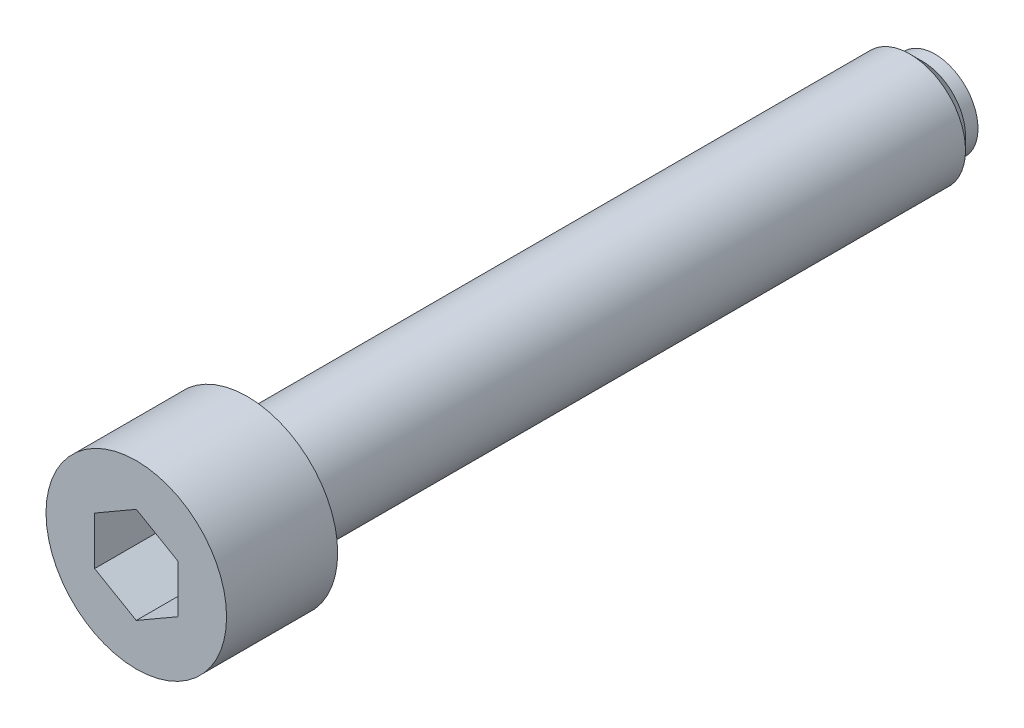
ISO-10303-21;
HEADER;
FILE_DESCRIPTION(('STEP AP214'),'2;1');
FILE_NAME('part.step','',(''),(''),'','','');
FILE_SCHEMA(('AUTOMOTIVE_DESIGN { 1 0 10303 214 1 1 1 1 }'));
ENDSEC;
DATA;
#1=APPLICATION_CONTEXT('core data for automotive mechanical design processes');
#2=APPLICATION_PROTOCOL_DEFINITION('international standard','automotive_design',2000,#1);
#3=PRODUCT_CONTEXT('',#1,'mechanical');
#4=PRODUCT('Part','Part','',(#3));
#5=PRODUCT_RELATED_PRODUCT_CATEGORY('part','',(#4));
#6=PRODUCT_DEFINITION_FORMATION('','',#4);
#7=PRODUCT_DEFINITION_CONTEXT('part definition',#1,'design');
#8=PRODUCT_DEFINITION('design','',#6,#7);
#9=PRODUCT_DEFINITION_SHAPE('','',#8);
#10=(LENGTH_UNIT() NAMED_UNIT(*) SI_UNIT(.MILLI.,.METRE.));
#11=(NAMED_UNIT(*) PLANE_ANGLE_UNIT() SI_UNIT($,.RADIAN.));
#12=(NAMED_UNIT(*) SI_UNIT($,.STERADIAN.) SOLID_ANGLE_UNIT());
#13=UNCERTAINTY_MEASURE_WITH_UNIT(LENGTH_MEASURE(1.E-05),#10,'distance_accuracy_value','');
#14=(GEOMETRIC_REPRESENTATION_CONTEXT(3) GLOBAL_UNCERTAINTY_ASSIGNED_CONTEXT((#13)) GLOBAL_UNIT_ASSIGNED_CONTEXT((#10,
#11,#12)) REPRESENTATION_CONTEXT('',''));
#15=CARTESIAN_POINT('',(0.,0.,0.));
#16=DIRECTION('',(0.,0.,1.));
#17=DIRECTION('',(1.,0.,0.));
#18=AXIS2_PLACEMENT_3D('',#15,#16,#17);
#19=CARTESIAN_POINT('',(0.,0.,1.58113883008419));
#20=DIRECTION('',(0.,0.,1.));
#21=DIRECTION('',(-1.,0.,0.));
#22=AXIS2_PLACEMENT_3D('',#19,#20,#21);
#23=SPHERICAL_SURFACE('',#22,2.75);
#24=CARTESIAN_POINT('',(0.,0.,0.5));
#25=DIRECTION('',(0.,0.,1.));
#26=DIRECTION('',(1.,0.,0.));
#27=AXIS2_PLACEMENT_3D('',#24,#25,#26);
#28=CIRCLE('',#27,2.52856457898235);
#29=CARTESIAN_POINT('',(-2.52856457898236,0.,0.5));
#30=VERTEX_POINT('',#29);
#31=EDGE_CURVE('E133',#30,#30,#28,.T.);
#32=CARTESIAN_POINT('',(0.,0.,0.));
#33=DIRECTION('',(0.,0.,1.));
#34=DIRECTION('',(1.,0.,0.));
#35=AXIS2_PLACEMENT_3D('',#32,#33,#34);
#36=CIRCLE('',#35,2.25);
#37=CARTESIAN_POINT('',(-2.25000000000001,0.,0.));
#38=VERTEX_POINT('',#37);
#39=EDGE_CURVE('E10',#38,#38,#36,.T.);
#40=CARTESIAN_POINT('',(-2.52856457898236,0.,0.5));
#41=CARTESIAN_POINT('',(-2.52621637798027,0.,0.494508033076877));
#42=CARTESIAN_POINT('',(-2.52385028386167,0.,0.489023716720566));
#43=CARTESIAN_POINT('',(-2.51908241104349,0.,0.478070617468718));
#44=CARTESIAN_POINT('',(-2.5166806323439,0.,0.472601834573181));
#45=CARTESIAN_POINT('',(-2.51184149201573,0.,0.461680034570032));
#46=CARTESIAN_POINT('',(-2.50940413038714,0.,0.456227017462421));
#47=CARTESIAN_POINT('',(-2.50449392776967,0.,0.445336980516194));
#48=CARTESIAN_POINT('',(-2.5020210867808,0.,0.439899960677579));
#49=CARTESIAN_POINT('',(-2.49704003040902,0.,0.429042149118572));
#50=CARTESIAN_POINT('',(-2.49453181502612,0.,0.423621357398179));
#51=CARTESIAN_POINT('',(-2.4894801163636,0.,0.41279623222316));
#52=CARTESIAN_POINT('',(-2.48693663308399,0.,0.407391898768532));
#53=CARTESIAN_POINT('',(-2.48181450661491,0.,0.396599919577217));
#54=CARTESIAN_POINT('',(-2.47923586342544,0.,0.391212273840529));
#55=CARTESIAN_POINT('',(-2.4740435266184,0.,0.380453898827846));
#56=CARTESIAN_POINT('',(-2.47142983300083,0.,0.375083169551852));
#57=CARTESIAN_POINT('',(-2.46616750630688,0.,0.364358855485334));
#58=CARTESIAN_POINT('',(-2.4635188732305,0.,0.35900527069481));
#59=CARTESIAN_POINT('',(-2.45818678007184,0.,0.348315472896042));
#60=CARTESIAN_POINT('',(-2.45550331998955,0.,0.342979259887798));
#61=CARTESIAN_POINT('',(-2.45010168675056,0.,0.332324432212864));
#62=CARTESIAN_POINT('',(-2.44738351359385,0.,0.327005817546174));
#63=CARTESIAN_POINT('',(-2.44191256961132,0.,0.316386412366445));
#64=CARTESIAN_POINT('',(-2.4391597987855,0.,0.311085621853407));
#65=CARTESIAN_POINT('',(-2.43361977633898,0.,0.300502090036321));
#66=CARTESIAN_POINT('',(-2.43083252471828,0.,0.295219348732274));
#67=CARTESIAN_POINT('',(-2.42522365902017,0.,0.284672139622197));
#68=CARTESIAN_POINT('',(-2.42240204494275,0.,0.279407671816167));
#69=CARTESIAN_POINT('',(-2.41672457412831,0.,0.268897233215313));
#70=CARTESIAN_POINT('',(-2.41386871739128,0.,0.263651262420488));
#71=CARTESIAN_POINT('',(-2.40812288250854,0.,0.253178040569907));
#72=CARTESIAN_POINT('',(-2.40523290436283,0.,0.247950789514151));
#73=CARTESIAN_POINT('',(-2.39941894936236,0.,0.237515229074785));
#74=CARTESIAN_POINT('',(-2.39649497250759,0.,0.232306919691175));
#75=CARTESIAN_POINT('',(-2.39061314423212,0.,0.221909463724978));
#76=CARTESIAN_POINT('',(-2.38765529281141,0.,0.21672031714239));
#77=CARTESIAN_POINT('',(-2.38170584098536,0.,0.206361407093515));
#78=CARTESIAN_POINT('',(-2.37871424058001,0.,0.201191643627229));
#79=CARTESIAN_POINT('',(-2.3726974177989,0.,0.190871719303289));
#80=CARTESIAN_POINT('',(-2.36967219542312,0.,0.185721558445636));
#81=CARTESIAN_POINT('',(-2.36358825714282,0.,0.175441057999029));
#82=CARTESIAN_POINT('',(-2.3605295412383,0.,0.170310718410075));
#83=CARTESIAN_POINT('',(-2.35437874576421,0.,0.160070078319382));
#84=CARTESIAN_POINT('',(-2.35128666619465,0.,0.154959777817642));
#85=CARTESIAN_POINT('',(-2.34506927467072,0.,0.144759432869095));
#86=CARTESIAN_POINT('',(-2.34194396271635,0.,0.139669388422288));
#87=CARTESIAN_POINT('',(-2.33566023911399,0.,0.129509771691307));
#88=CARTESIAN_POINT('',(-2.33250182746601,0.,0.124440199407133));
#89=CARTESIAN_POINT('',(-2.32615203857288,0.,0.114321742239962));
#90=CARTESIAN_POINT('',(-2.32296066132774,0.,0.109272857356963));
#91=CARTESIAN_POINT('',(-2.31654507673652,0.,0.0991959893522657));
#92=CARTESIAN_POINT('',(-2.31332086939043,0.,0.0941680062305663));
#93=CARTESIAN_POINT('',(-2.30683976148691,0.,0.0841331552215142));
#94=CARTESIAN_POINT('',(-2.30358286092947,0.,0.0791262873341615));
#95=CARTESIAN_POINT('',(-2.29703650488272,0.,0.069133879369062));
#96=CARTESIAN_POINT('',(-2.29374704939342,0.,0.0641483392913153));
#97=CARTESIAN_POINT('',(-2.28713572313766,0.,0.0541987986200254));
#98=CARTESIAN_POINT('',(-2.2838138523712,0.,0.0492347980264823));
#99=CARTESIAN_POINT('',(-2.27713783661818,0.,0.0393285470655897));
#100=CARTESIAN_POINT('',(-2.27378369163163,0.,0.0343862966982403));
#101=CARTESIAN_POINT('',(-2.26704326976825,0.,0.0245237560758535));
#102=CARTESIAN_POINT('',(-2.26365699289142,0.,0.0196034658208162));
#103=CARTESIAN_POINT('',(-2.25685245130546,0.,0.00978505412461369));
#104=CARTESIAN_POINT('',(-2.25343418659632,0.,0.00488693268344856));
#105=CARTESIAN_POINT('',(-2.25000000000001,0.,0.));
#106=B_SPLINE_CURVE_WITH_KNOTS('',3,(#40,#41,#42,#43,#44,#45,#46,#47,#48,#49,#50,#51,#52,#53,
#54,#55,#56,#57,#58,#59,#60,#61,#62,#63,#64,#65,#66,#67,#68,#69,#70,#71,#72,#73,#74,#75,#76,#77,
#78,#79,#80,#81,#82,#83,#84,#85,#86,#87,#88,#89,#90,#91,#92,#93,#94,#95,#96,#97,#98,#99,#100,
#101,#102,#103,#104,#105),.UNSPECIFIED.,.F.,.F.,(4,2,2,2,2,2,2,2,2,2,2,2,2,2,2,2,2,2,2,2,2,2,2,
2,2,2,2,2,2,2,2,2,4),(0.,0.0179187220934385,0.0358374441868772,0.0537561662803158,
0.0716748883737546,0.089593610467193,0.107512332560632,0.125431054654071,0.143349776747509,
0.161268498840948,0.179187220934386,0.197105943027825,0.215024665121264,0.232943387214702,
0.250862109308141,0.26878083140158,0.286699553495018,0.304618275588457,0.322536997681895,
0.340455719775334,0.358374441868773,0.376293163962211,0.39421188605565,0.412130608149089,
0.430049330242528,0.447968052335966,0.465886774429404,0.483805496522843,0.501724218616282,
0.519642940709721,0.537561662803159,0.555480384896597,0.573399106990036),.UNSPECIFIED.);
#107=EDGE_CURVE('BSEAM16',#30,#38,#106,.T.);
#108=ORIENTED_EDGE('',*,*,#31,.F.);
#109=ORIENTED_EDGE('',*,*,#39,.T.);
#110=ORIENTED_EDGE('',*,*,#107,.T.);
#111=ORIENTED_EDGE('',*,*,#107,.F.);
#112=EDGE_LOOP('',(#108,#110,#109,#111));
#113=FACE_BOUND('',#112,.T.);
#114=ADVANCED_FACE('F16',(#113),#23,.T.);
#115=CARTESIAN_POINT('',(0.,0.,0.));
#116=DIRECTION('',(0.,0.,1.));
#117=DIRECTION('',(1.,0.,0.));
#118=AXIS2_PLACEMENT_3D('',#115,#116,#117);
#119=PLANE('',#118);
#120=ORIENTED_EDGE('',*,*,#39,.F.);
#121=EDGE_LOOP('',(#120));
#122=FACE_BOUND('',#121,.T.);
#123=ADVANCED_FACE('F208',(#122),#119,.F.);
#124=CARTESIAN_POINT('',(-6.5,0.,58.));
#125=DIRECTION('',(0.,0.,-1.));
#126=DIRECTION('',(-1.,0.,0.));
#127=AXIS2_PLACEMENT_3D('',#124,#125,#126);
#128=PLANE('',#127);
#129=DIRECTION('',(-0.866025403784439,-0.5,0.));
#130=VECTOR('',#129,1.);
#131=CARTESIAN_POINT('',(0.,3.46410161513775,58.));
#132=LINE('',#131,#130);
#133=CARTESIAN_POINT('',(0.,3.46410161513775,58.));
#134=VERTEX_POINT('',#133);
#135=CARTESIAN_POINT('',(-3.,1.73205080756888,58.));
#136=VERTEX_POINT('',#135);
#137=EDGE_CURVE('E114',#134,#136,#132,.T.);
#138=ORIENTED_EDGE('',*,*,#137,.F.);
#139=DIRECTION('',(-0.866025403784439,0.5,0.));
#140=VECTOR('',#139,1.);
#141=CARTESIAN_POINT('',(3.,1.73205080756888,58.));
#142=LINE('',#141,#140);
#143=CARTESIAN_POINT('',(3.,1.73205080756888,58.));
#144=VERTEX_POINT('',#143);
#145=EDGE_CURVE('E31',#144,#134,#142,.T.);
#146=ORIENTED_EDGE('',*,*,#145,.F.);
#147=DIRECTION('',(0.,1.,0.));
#148=VECTOR('',#147,1.);
#149=CARTESIAN_POINT('',(3.,-1.73205080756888,58.));
#150=LINE('',#149,#148);
#151=CARTESIAN_POINT('',(3.,-1.73205080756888,58.));
#152=VERTEX_POINT('',#151);
#153=EDGE_CURVE('E127',#152,#144,#150,.T.);
#154=ORIENTED_EDGE('',*,*,#153,.F.);
#155=DIRECTION('',(0.866025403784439,0.5,0.));
#156=VECTOR('',#155,1.);
#157=CARTESIAN_POINT('',(0.,-3.46410161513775,58.));
#158=LINE('',#157,#156);
#159=CARTESIAN_POINT('',(0.,-3.46410161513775,58.));
#160=VERTEX_POINT('',#159);
#161=EDGE_CURVE('E124',#160,#152,#158,.T.);
#162=ORIENTED_EDGE('',*,*,#161,.F.);
#163=DIRECTION('',(0.866025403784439,-0.5,0.));
#164=VECTOR('',#163,1.);
#165=CARTESIAN_POINT('',(-3.,-1.73205080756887,58.));
#166=LINE('',#165,#164);
#167=CARTESIAN_POINT('',(-3.,-1.73205080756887,58.));
#168=VERTEX_POINT('',#167);
#169=EDGE_CURVE('E79',#168,#160,#166,.T.);
#170=ORIENTED_EDGE('',*,*,#169,.F.);
#171=DIRECTION('',(0.,-1.,0.));
#172=VECTOR('',#171,1.);
#173=CARTESIAN_POINT('',(-3.,1.73205080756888,58.));
#174=LINE('',#173,#172);
#175=EDGE_CURVE('E118',#136,#168,#174,.T.);
#176=ORIENTED_EDGE('',*,*,#175,.F.);
#177=EDGE_LOOP('',(#138,#146,#154,#162,#170,#176));
#178=FACE_BOUND('',#177,.T.);
#179=CARTESIAN_POINT('',(0.,0.,58.));
#180=DIRECTION('',(0.,0.,1.));
#181=DIRECTION('',(1.,0.,0.));
#182=AXIS2_PLACEMENT_3D('',#179,#180,#181);
#183=CIRCLE('',#182,6.5);
#184=CARTESIAN_POINT('',(6.5,0.,58.));
#185=VERTEX_POINT('',#184);
#186=EDGE_CURVE('E24',#185,#185,#183,.T.);
#187=ORIENTED_EDGE('',*,*,#186,.T.);
#188=EDGE_LOOP('',(#187));
#189=FACE_BOUND('',#188,.T.);
#190=ADVANCED_FACE('F167',(#178,#189),#128,.F.);
#191=CARTESIAN_POINT('',(0.,0.,0.));
#192=DIRECTION('',(0.,0.,1.));
#193=DIRECTION('',(1.,0.,0.));
#194=AXIS2_PLACEMENT_3D('',#191,#192,#193);
#195=CYLINDRICAL_SURFACE('',#194,6.5);
#196=ORIENTED_EDGE('',*,*,#186,.F.);
#197=EDGE_LOOP('',(#196));
#198=FACE_BOUND('',#197,.T.);
#199=CARTESIAN_POINT('',(0.,0.,50.));
#200=DIRECTION('',(0.,0.,1.));
#201=DIRECTION('',(1.,0.,0.));
#202=AXIS2_PLACEMENT_3D('',#199,#200,#201);
#203=CIRCLE('',#202,6.5);
#204=CARTESIAN_POINT('',(6.5,0.,50.));
#205=VERTEX_POINT('',#204);
#206=EDGE_CURVE('E160',#205,#205,#203,.T.);
#207=ORIENTED_EDGE('',*,*,#206,.T.);
#208=EDGE_LOOP('',(#207));
#209=FACE_BOUND('',#208,.T.);
#210=ADVANCED_FACE('F169',(#198,#209),#195,.T.);
#211=CARTESIAN_POINT('',(-4.,0.,50.));
#212=DIRECTION('',(0.,0.,1.));
#213=DIRECTION('',(1.,0.,0.));
#214=AXIS2_PLACEMENT_3D('',#211,#212,#213);
#215=PLANE('',#214);
#216=ORIENTED_EDGE('',*,*,#206,.F.);
#217=EDGE_LOOP('',(#216));
#218=FACE_BOUND('',#217,.T.);
#219=CARTESIAN_POINT('',(0.,0.,50.));
#220=DIRECTION('',(0.,0.,1.));
#221=DIRECTION('',(1.,0.,0.));
#222=AXIS2_PLACEMENT_3D('',#219,#220,#221);
#223=CIRCLE('',#222,4.);
#224=CARTESIAN_POINT('',(4.,0.,50.));
#225=VERTEX_POINT('',#224);
#226=EDGE_CURVE('E157',#225,#225,#223,.T.);
#227=ORIENTED_EDGE('',*,*,#226,.T.);
#228=EDGE_LOOP('',(#227));
#229=FACE_BOUND('',#228,.T.);
#230=ADVANCED_FACE('F172',(#218,#229),#215,.F.);
#231=CARTESIAN_POINT('',(0.,0.,0.));
#232=DIRECTION('',(0.,0.,1.));
#233=DIRECTION('',(1.,0.,0.));
#234=AXIS2_PLACEMENT_3D('',#231,#232,#233);
#235=CYLINDRICAL_SURFACE('',#234,4.);
#236=ORIENTED_EDGE('',*,*,#226,.F.);
#237=EDGE_LOOP('',(#236));
#238=FACE_BOUND('',#237,.T.);
#239=CARTESIAN_POINT('',(0.,0.,2.3));
#240=DIRECTION('',(0.,0.,1.));
#241=DIRECTION('',(1.,0.,0.));
#242=AXIS2_PLACEMENT_3D('',#239,#240,#241);
#243=CIRCLE('',#242,4.);
#244=CARTESIAN_POINT('',(4.,0.,2.3));
#245=VERTEX_POINT('',#244);
#246=EDGE_CURVE('E153',#245,#245,#243,.T.);
#247=ORIENTED_EDGE('',*,*,#246,.T.);
#248=EDGE_LOOP('',(#247));
#249=FACE_BOUND('',#248,.T.);
#250=ADVANCED_FACE('F178',(#238,#249),#235,.T.);
#251=CARTESIAN_POINT('',(0.,0.,1.4));
#252=DIRECTION('',(0.,0.,1.));
#253=DIRECTION('',(1.,0.,0.));
#254=AXIS2_PLACEMENT_3D('',#251,#252,#253);
#255=CONICAL_SURFACE('',#254,3.1,0.785398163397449);
#256=ORIENTED_EDGE('',*,*,#246,.F.);
#257=EDGE_LOOP('',(#256));
#258=FACE_BOUND('',#257,.T.);
#259=CARTESIAN_POINT('',(0.,0.,1.4));
#260=DIRECTION('',(0.,0.,1.));
#261=DIRECTION('',(1.,0.,0.));
#262=AXIS2_PLACEMENT_3D('',#259,#260,#261);
#263=CIRCLE('',#262,3.1);
#264=CARTESIAN_POINT('',(3.1,0.,1.4));
#265=VERTEX_POINT('',#264);
#266=EDGE_CURVE('E149',#265,#265,#263,.T.);
#267=ORIENTED_EDGE('',*,*,#266,.T.);
#268=EDGE_LOOP('',(#267));
#269=FACE_BOUND('',#268,.T.);
#270=ADVANCED_FACE('F184',(#258,#269),#255,.T.);
#271=CARTESIAN_POINT('',(0.,0.,0.));
#272=DIRECTION('',(0.,0.,1.));
#273=DIRECTION('',(1.,0.,0.));
#274=AXIS2_PLACEMENT_3D('',#271,#272,#273);
#275=CYLINDRICAL_SURFACE('',#274,3.1);
#276=ORIENTED_EDGE('',*,*,#266,.F.);
#277=EDGE_LOOP('',(#276));
#278=FACE_BOUND('',#277,.T.);
#279=CARTESIAN_POINT('',(0.,0.,0.5));
#280=DIRECTION('',(0.,0.,1.));
#281=DIRECTION('',(1.,0.,0.));
#282=AXIS2_PLACEMENT_3D('',#279,#280,#281);
#283=CIRCLE('',#282,3.1);
#284=CARTESIAN_POINT('',(3.1,0.,0.5));
#285=VERTEX_POINT('',#284);
#286=EDGE_CURVE('E145',#285,#285,#283,.T.);
#287=ORIENTED_EDGE('',*,*,#286,.T.);
#288=EDGE_LOOP('',(#287));
#289=FACE_BOUND('',#288,.T.);
#290=ADVANCED_FACE('F190',(#278,#289),#275,.T.);
#291=CARTESIAN_POINT('',(-2.52856457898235,0.,0.5));
#292=DIRECTION('',(0.,0.,1.));
#293=DIRECTION('',(1.,0.,0.));
#294=AXIS2_PLACEMENT_3D('',#291,#292,#293);
#295=PLANE('',#294);
#296=ORIENTED_EDGE('',*,*,#286,.F.);
#297=EDGE_LOOP('',(#296));
#298=FACE_BOUND('',#297,.T.);
#299=ORIENTED_EDGE('',*,*,#31,.T.);
#300=EDGE_LOOP('',(#299));
#301=FACE_BOUND('',#300,.T.);
#302=ADVANCED_FACE('F196',(#298,#301),#295,.F.);
#303=CARTESIAN_POINT('',(3.,1.73205080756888,53.));
#304=DIRECTION('',(0.5,0.866025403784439,0.));
#305=DIRECTION('',(-0.866025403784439,0.5,0.));
#306=AXIS2_PLACEMENT_3D('',#303,#304,#305);
#307=PLANE('',#306);
#308=ORIENTED_EDGE('',*,*,#145,.T.);
#309=DIRECTION('',(0.,0.,1.));
#310=VECTOR('',#309,1.);
#311=CARTESIAN_POINT('',(0.,3.46410161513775,53.));
#312=LINE('',#311,#310);
#313=CARTESIAN_POINT('',(0.,3.46410161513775,53.));
#314=VERTEX_POINT('',#313);
#315=EDGE_CURVE('E61',#314,#134,#312,.T.);
#316=ORIENTED_EDGE('',*,*,#315,.F.);
#317=DIRECTION('',(-0.866025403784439,0.5,0.));
#318=VECTOR('',#317,1.);
#319=CARTESIAN_POINT('',(3.,1.73205080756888,53.));
#320=LINE('',#319,#318);
#321=CARTESIAN_POINT('',(3.,1.73205080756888,53.));
#322=VERTEX_POINT('',#321);
#323=EDGE_CURVE('E130',#322,#314,#320,.T.);
#324=ORIENTED_EDGE('',*,*,#323,.F.);
#325=DIRECTION('',(0.,0.,1.));
#326=VECTOR('',#325,1.);
#327=CARTESIAN_POINT('',(3.,1.73205080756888,53.));
#328=LINE('',#327,#326);
#329=EDGE_CURVE('E39',#322,#144,#328,.T.);
#330=ORIENTED_EDGE('',*,*,#329,.T.);
#331=EDGE_LOOP('',(#308,#316,#324,#330));
#332=FACE_BOUND('',#331,.T.);
#333=ADVANCED_FACE('F202',(#332),#307,.F.);
#334=CARTESIAN_POINT('',(3.,-1.73205080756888,53.));
#335=DIRECTION('',(1.,0.,0.));
#336=DIRECTION('',(0.,0.,-1.));
#337=AXIS2_PLACEMENT_3D('',#334,#335,#336);
#338=PLANE('',#337);
#339=ORIENTED_EDGE('',*,*,#153,.T.);
#340=ORIENTED_EDGE('',*,*,#329,.F.);
#341=DIRECTION('',(0.,1.,0.));
#342=VECTOR('',#341,1.);
#343=CARTESIAN_POINT('',(3.,-1.73205080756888,53.));
#344=LINE('',#343,#342);
#345=CARTESIAN_POINT('',(3.,-1.73205080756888,53.));
#346=VERTEX_POINT('',#345);
#347=EDGE_CURVE('E93',#346,#322,#344,.T.);
#348=ORIENTED_EDGE('',*,*,#347,.F.);
#349=DIRECTION('',(0.,0.,1.));
#350=VECTOR('',#349,1.);
#351=CARTESIAN_POINT('',(3.,-1.73205080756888,53.));
#352=LINE('',#351,#350);
#353=EDGE_CURVE('E84',#346,#152,#352,.T.);
#354=ORIENTED_EDGE('',*,*,#353,.T.);
#355=EDGE_LOOP('',(#339,#340,#348,#354));
#356=FACE_BOUND('',#355,.T.);
#357=ADVANCED_FACE('F222',(#356),#338,.F.);
#358=CARTESIAN_POINT('',(0.,-3.46410161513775,53.));
#359=DIRECTION('',(0.5,-0.866025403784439,0.));
#360=DIRECTION('',(0.866025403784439,0.5,0.));
#361=AXIS2_PLACEMENT_3D('',#358,#359,#360);
#362=PLANE('',#361);
#363=ORIENTED_EDGE('',*,*,#161,.T.);
#364=ORIENTED_EDGE('',*,*,#353,.F.);
#365=DIRECTION('',(0.866025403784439,0.5,0.));
#366=VECTOR('',#365,1.);
#367=CARTESIAN_POINT('',(0.,-3.46410161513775,53.));
#368=LINE('',#367,#366);
#369=CARTESIAN_POINT('',(0.,-3.46410161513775,53.));
#370=VERTEX_POINT('',#369);
#371=EDGE_CURVE('E88',#370,#346,#368,.T.);
#372=ORIENTED_EDGE('',*,*,#371,.F.);
#373=DIRECTION('',(0.,0.,1.));
#374=VECTOR('',#373,1.);
#375=CARTESIAN_POINT('',(0.,-3.46410161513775,53.));
#376=LINE('',#375,#374);
#377=EDGE_CURVE('E72',#370,#160,#376,.T.);
#378=ORIENTED_EDGE('',*,*,#377,.T.);
#379=EDGE_LOOP('',(#363,#364,#372,#378));
#380=FACE_BOUND('',#379,.T.);
#381=ADVANCED_FACE('F89',(#380),#362,.F.);
#382=CARTESIAN_POINT('',(-3.,-1.73205080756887,53.));
#383=DIRECTION('',(-0.5,-0.866025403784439,0.));
#384=DIRECTION('',(0.866025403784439,-0.5,0.));
#385=AXIS2_PLACEMENT_3D('',#382,#383,#384);
#386=PLANE('',#385);
#387=ORIENTED_EDGE('',*,*,#169,.T.);
#388=ORIENTED_EDGE('',*,*,#377,.F.);
#389=DIRECTION('',(0.866025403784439,-0.5,0.));
#390=VECTOR('',#389,1.);
#391=CARTESIAN_POINT('',(-3.,-1.73205080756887,53.));
#392=LINE('',#391,#390);
#393=CARTESIAN_POINT('',(-3.,-1.73205080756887,53.));
#394=VERTEX_POINT('',#393);
#395=EDGE_CURVE('E76',#394,#370,#392,.T.);
#396=ORIENTED_EDGE('',*,*,#395,.F.);
#397=DIRECTION('',(0.,0.,1.));
#398=VECTOR('',#397,1.);
#399=CARTESIAN_POINT('',(-3.,-1.73205080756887,53.));
#400=LINE('',#399,#398);
#401=EDGE_CURVE('E85',#394,#168,#400,.T.);
#402=ORIENTED_EDGE('',*,*,#401,.T.);
#403=EDGE_LOOP('',(#387,#388,#396,#402));
#404=FACE_BOUND('',#403,.T.);
#405=ADVANCED_FACE('F74',(#404),#386,.F.);
#406=CARTESIAN_POINT('',(-3.,1.73205080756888,53.));
#407=DIRECTION('',(-1.,0.,0.));
#408=DIRECTION('',(0.,0.,1.));
#409=AXIS2_PLACEMENT_3D('',#406,#407,#408);
#410=PLANE('',#409);
#411=ORIENTED_EDGE('',*,*,#175,.T.);
#412=ORIENTED_EDGE('',*,*,#401,.F.);
#413=DIRECTION('',(0.,-1.,0.));
#414=VECTOR('',#413,1.);
#415=CARTESIAN_POINT('',(-3.,1.73205080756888,53.));
#416=LINE('',#415,#414);
#417=CARTESIAN_POINT('',(-3.,1.73205080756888,53.));
#418=VERTEX_POINT('',#417);
#419=EDGE_CURVE('E99',#418,#394,#416,.T.);
#420=ORIENTED_EDGE('',*,*,#419,.F.);
#421=DIRECTION('',(0.,0.,1.));
#422=VECTOR('',#421,1.);
#423=CARTESIAN_POINT('',(-3.,1.73205080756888,53.));
#424=LINE('',#423,#422);
#425=EDGE_CURVE('E138',#418,#136,#424,.T.);
#426=ORIENTED_EDGE('',*,*,#425,.T.);
#427=EDGE_LOOP('',(#411,#412,#420,#426));
#428=FACE_BOUND('',#427,.T.);
#429=ADVANCED_FACE('F226',(#428),#410,.F.);
#430=CARTESIAN_POINT('',(0.,3.46410161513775,53.));
#431=DIRECTION('',(-0.5,0.866025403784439,0.));
#432=DIRECTION('',(-0.866025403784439,-0.5,0.));
#433=AXIS2_PLACEMENT_3D('',#430,#431,#432);
#434=PLANE('',#433);
#435=ORIENTED_EDGE('',*,*,#137,.T.);
#436=ORIENTED_EDGE('',*,*,#425,.F.);
#437=DIRECTION('',(-0.866025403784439,-0.5,0.));
#438=VECTOR('',#437,1.);
#439=CARTESIAN_POINT('',(0.,3.46410161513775,53.));
#440=LINE('',#439,#438);
#441=EDGE_CURVE('E106',#314,#418,#440,.T.);
#442=ORIENTED_EDGE('',*,*,#441,.F.);
#443=ORIENTED_EDGE('',*,*,#315,.T.);
#444=EDGE_LOOP('',(#435,#436,#442,#443));
#445=FACE_BOUND('',#444,.T.);
#446=ADVANCED_FACE('F223',(#445),#434,.F.);
#447=CARTESIAN_POINT('',(0.,0.,53.));
#448=DIRECTION('',(0.,0.,1.));
#449=DIRECTION('',(1.,0.,0.));
#450=AXIS2_PLACEMENT_3D('',#447,#448,#449);
#451=PLANE('',#450);
#452=ORIENTED_EDGE('',*,*,#323,.T.);
#453=ORIENTED_EDGE('',*,*,#441,.T.);
#454=ORIENTED_EDGE('',*,*,#419,.T.);
#455=ORIENTED_EDGE('',*,*,#395,.T.);
#456=ORIENTED_EDGE('',*,*,#371,.T.);
#457=ORIENTED_EDGE('',*,*,#347,.T.);
#458=EDGE_LOOP('',(#452,#453,#454,#455,#456,#457));
#459=FACE_BOUND('',#458,.T.);
#460=ADVANCED_FACE('F96',(#459),#451,.T.);
#461=CLOSED_SHELL('',(#114,#123,#190,#210,#230,#250,#270,#290,#302,#333,#357,#381,#405,#429,
#446,#460));
#462=MANIFOLD_SOLID_BREP('B1',#461);
#463=ADVANCED_BREP_SHAPE_REPRESENTATION('',(#18,#462),#14);
#464=SHAPE_DEFINITION_REPRESENTATION(#9,#463);
ENDSEC;
END-ISO-10303-21;
